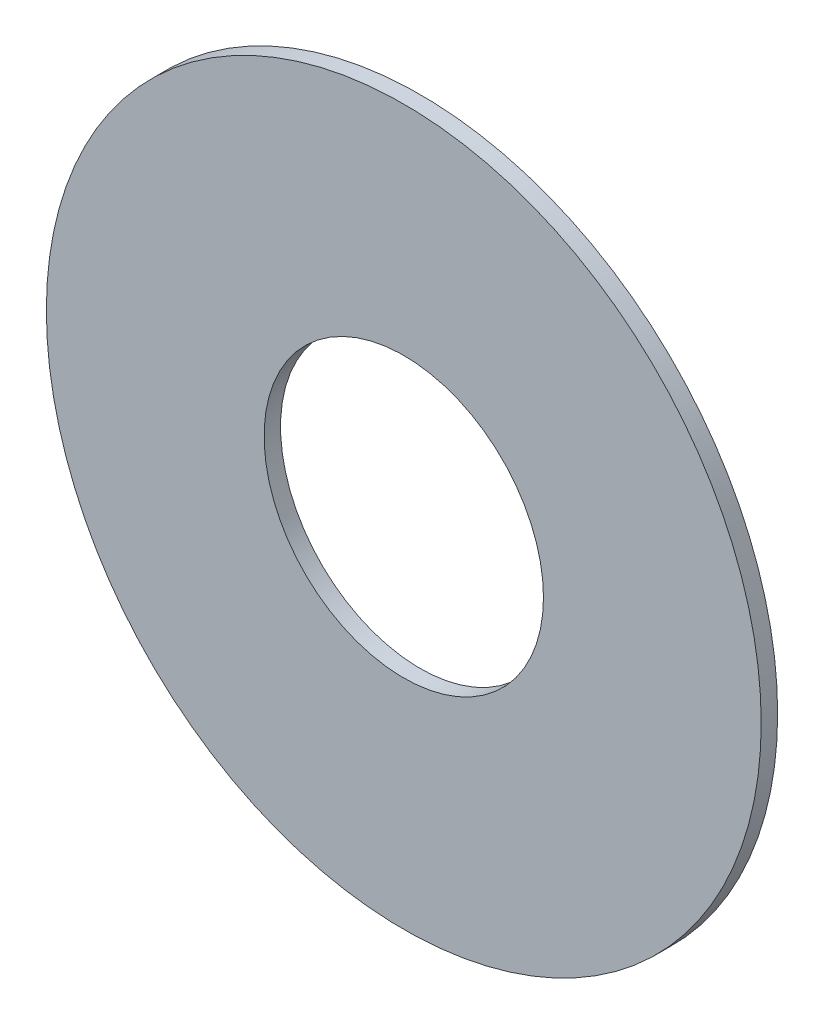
ISO-10303-21;
HEADER;
FILE_DESCRIPTION(('STEP AP214'),'2;1');
FILE_NAME('part.step','',(''),(''),'','','');
FILE_SCHEMA(('AUTOMOTIVE_DESIGN { 1 0 10303 214 1 1 1 1 }'));
ENDSEC;
DATA;
#1=APPLICATION_CONTEXT('core data for automotive mechanical design processes');
#2=APPLICATION_PROTOCOL_DEFINITION('international standard','automotive_design',2000,#1);
#3=PRODUCT_CONTEXT('',#1,'mechanical');
#4=PRODUCT('Part','Part','',(#3));
#5=PRODUCT_RELATED_PRODUCT_CATEGORY('part','',(#4));
#6=PRODUCT_DEFINITION_FORMATION('','',#4);
#7=PRODUCT_DEFINITION_CONTEXT('part definition',#1,'design');
#8=PRODUCT_DEFINITION('design','',#6,#7);
#9=PRODUCT_DEFINITION_SHAPE('','',#8);
#10=(LENGTH_UNIT() NAMED_UNIT(*) SI_UNIT(.MILLI.,.METRE.));
#11=(NAMED_UNIT(*) PLANE_ANGLE_UNIT() SI_UNIT($,.RADIAN.));
#12=(NAMED_UNIT(*) SI_UNIT($,.STERADIAN.) SOLID_ANGLE_UNIT());
#13=UNCERTAINTY_MEASURE_WITH_UNIT(LENGTH_MEASURE(1.E-05),#10,'distance_accuracy_value','');
#14=(GEOMETRIC_REPRESENTATION_CONTEXT(3) GLOBAL_UNCERTAINTY_ASSIGNED_CONTEXT((#13)) GLOBAL_UNIT_ASSIGNED_CONTEXT((#10,
#11,#12)) REPRESENTATION_CONTEXT('',''));
#15=CARTESIAN_POINT('',(0.,0.,0.));
#16=DIRECTION('',(0.,0.,1.));
#17=DIRECTION('',(1.,0.,0.));
#18=AXIS2_PLACEMENT_3D('',#15,#16,#17);
#19=CARTESIAN_POINT('',(0.,0.,-100.));
#20=DIRECTION('',(0.,0.,1.));
#21=DIRECTION('',(1.,0.,0.));
#22=AXIS2_PLACEMENT_3D('',#19,#20,#21);
#23=CYLINDRICAL_SURFACE('',#22,2175.);
#24=CARTESIAN_POINT('',(0.,0.,-100.));
#25=DIRECTION('',(0.,0.,1.));
#26=DIRECTION('',(1.,0.,0.));
#27=AXIS2_PLACEMENT_3D('',#24,#25,#26);
#28=CIRCLE('',#27,2175.);
#29=CARTESIAN_POINT('',(2175.,0.,-100.));
#30=VERTEX_POINT('',#29);
#31=EDGE_CURVE('E10',#30,#30,#28,.T.);
#32=ORIENTED_EDGE('',*,*,#31,.T.);
#33=EDGE_LOOP('',(#32));
#34=FACE_BOUND('',#33,.T.);
#35=CARTESIAN_POINT('',(0.,0.,0.));
#36=DIRECTION('',(0.,0.,1.));
#37=DIRECTION('',(1.,0.,0.));
#38=AXIS2_PLACEMENT_3D('',#35,#36,#37);
#39=CIRCLE('',#38,2175.);
#40=CARTESIAN_POINT('',(2175.,0.,0.));
#41=VERTEX_POINT('',#40);
#42=EDGE_CURVE('E40',#41,#41,#39,.T.);
#43=ORIENTED_EDGE('',*,*,#42,.F.);
#44=EDGE_LOOP('',(#43));
#45=FACE_BOUND('',#44,.T.);
#46=ADVANCED_FACE('F37',(#34,#45),#23,.T.);
#47=CARTESIAN_POINT('',(0.,0.,-100.));
#48=DIRECTION('',(0.,0.,1.));
#49=DIRECTION('',(1.,0.,0.));
#50=AXIS2_PLACEMENT_3D('',#47,#48,#49);
#51=PLANE('',#50);
#52=CARTESIAN_POINT('',(0.,0.,-100.));
#53=DIRECTION('',(0.,0.,1.));
#54=DIRECTION('',(1.,0.,0.));
#55=AXIS2_PLACEMENT_3D('',#52,#53,#54);
#56=CIRCLE('',#55,850.);
#57=CARTESIAN_POINT('',(850.,0.,-100.));
#58=VERTEX_POINT('',#57);
#59=EDGE_CURVE('E49',#58,#58,#56,.T.);
#60=ORIENTED_EDGE('',*,*,#59,.T.);
#61=EDGE_LOOP('',(#60));
#62=FACE_BOUND('',#61,.T.);
#63=ORIENTED_EDGE('',*,*,#31,.F.);
#64=EDGE_LOOP('',(#63));
#65=FACE_BOUND('',#64,.T.);
#66=ADVANCED_FACE('F59',(#62,#65),#51,.F.);
#67=CARTESIAN_POINT('',(0.,0.,0.));
#68=DIRECTION('',(0.,0.,1.));
#69=DIRECTION('',(1.,0.,0.));
#70=AXIS2_PLACEMENT_3D('',#67,#68,#69);
#71=PLANE('',#70);
#72=CARTESIAN_POINT('',(0.,0.,0.));
#73=DIRECTION('',(0.,0.,1.));
#74=DIRECTION('',(1.,0.,0.));
#75=AXIS2_PLACEMENT_3D('',#72,#73,#74);
#76=CIRCLE('',#75,850.);
#77=CARTESIAN_POINT('',(850.,0.,0.));
#78=VERTEX_POINT('',#77);
#79=EDGE_CURVE('E51',#78,#78,#76,.T.);
#80=ORIENTED_EDGE('',*,*,#79,.F.);
#81=EDGE_LOOP('',(#80));
#82=FACE_BOUND('',#81,.T.);
#83=ORIENTED_EDGE('',*,*,#42,.T.);
#84=EDGE_LOOP('',(#83));
#85=FACE_BOUND('',#84,.T.);
#86=ADVANCED_FACE('F65',(#82,#85),#71,.T.);
#87=CARTESIAN_POINT('',(0.,0.,-100.));
#88=DIRECTION('',(0.,0.,1.));
#89=DIRECTION('',(1.,0.,0.));
#90=AXIS2_PLACEMENT_3D('',#87,#88,#89);
#91=CYLINDRICAL_SURFACE('',#90,850.);
#92=ORIENTED_EDGE('',*,*,#59,.F.);
#93=EDGE_LOOP('',(#92));
#94=FACE_BOUND('',#93,.T.);
#95=ORIENTED_EDGE('',*,*,#79,.T.);
#96=EDGE_LOOP('',(#95));
#97=FACE_BOUND('',#96,.T.);
#98=ADVANCED_FACE('F62',(#94,#97),#91,.F.);
#99=CLOSED_SHELL('',(#46,#66,#86,#98));
#100=MANIFOLD_SOLID_BREP('B2',#99);
#101=ADVANCED_BREP_SHAPE_REPRESENTATION('',(#18,#100),#14);
#102=SHAPE_DEFINITION_REPRESENTATION(#9,#101);
ENDSEC;
END-ISO-10303-21;
